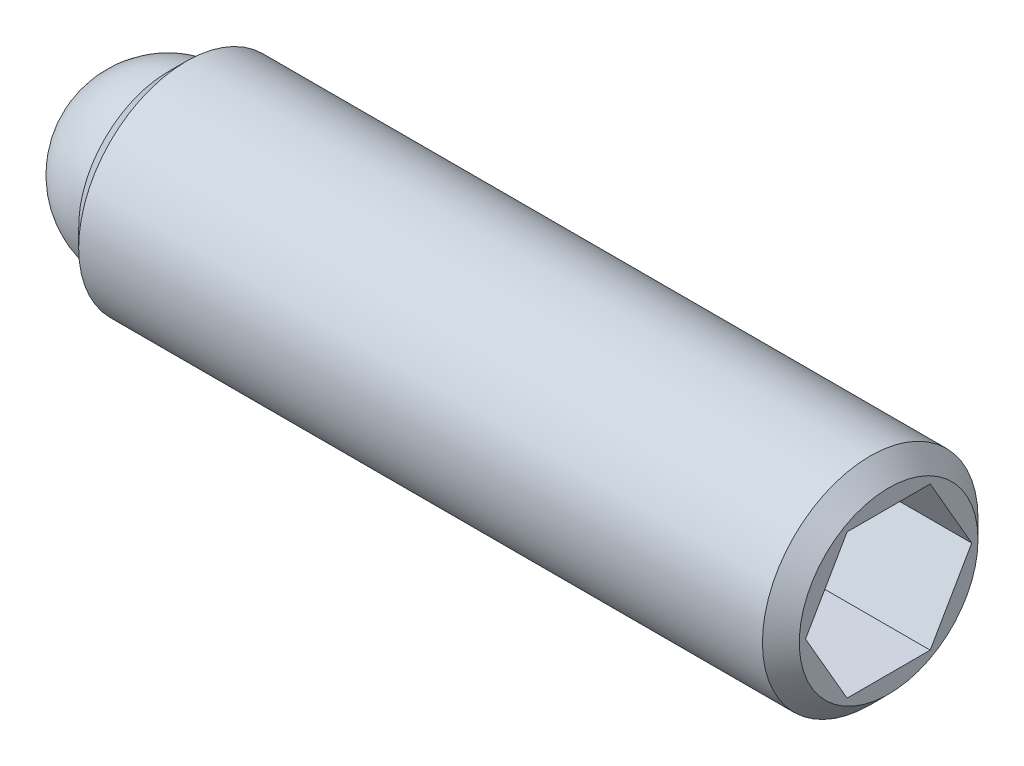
from build123d import *

# Parameters (mm, degrees)
SKETCH2_R           = 1.4859
BOSS_EXTRUDE1_DEPTH = 9.934575
CHAMFER1_SIZE       = 0.254
CHAMFER2_SIZE       = 0.254
CUT_EXTRUDE2_DEPTH  = 2.286
SKETCH3_R           = 1.190625
CUT_EXTRUDE3_DEPTH  = 1.190625


with BuildPart() as part:
    # Sketch2 → Boss-Extrude1 (new body)
    with BuildSketch(Plane(origin=(0, 0, 0), x_dir=(0, 0, -1), z_dir=(1, 0, 0))):
        Circle(SKETCH2_R)
    extrude(amount=BOSS_EXTRUDE1_DEPTH)

    # Chamfer1
    chamfer1_edges = [part.edges().sort_by_distance(p)[0] for p in [
        (0, 0, 1.4859),
    ]]
    chamfer(chamfer1_edges, length=CHAMFER1_SIZE)

    # Chamfer2
    chamfer2_edges = [part.edges().sort_by_distance(p)[0] for p in [
        (9.934575, 0, 1.4859),
    ]]
    chamfer(chamfer2_edges, length=CHAMFER2_SIZE)

    # Sketch4 → Cut-Extrude2 (cut)
    with BuildSketch(Plane(origin=(9.934575, 0, 0), x_dir=(0, 0, -1), z_dir=(1, 0, 0))):
        Polygon((1.14567944, 0), (0.57283972, 0.9921875), (-0.57283972, 0.9921875), (-1.14567944, 0), (-0.57283972, -0.9921875), (0.57283972, -0.9921875), align=None)
    extrude(amount=-CUT_EXTRUDE2_DEPTH, mode=Mode.SUBTRACT)

    # Sketch3 → Cut-Extrude3 (cut)
    with BuildSketch(Plane.ZY):
        Circle(SKETCH3_R)
    extrude(amount=-CUT_EXTRUDE3_DEPTH, mode=Mode.SUBTRACT)


with BuildPart() as body_2:
    # Sketch5 → Revolve1 (revolve)
    with BuildSketch(Plane.ZY):
        with BuildLine():
            Line((0, 0), (0, -1.190625))
            ThreePointArc((0, -1.190625), (-1.190625, 0), (0, 1.190625))
            Line((0, 1.190625), (0, 0))
        make_face()
    revolve(axis=Axis((0, 0, 0), (0, 1, 0)))


solid = Compound([part.part, body_2.part])
